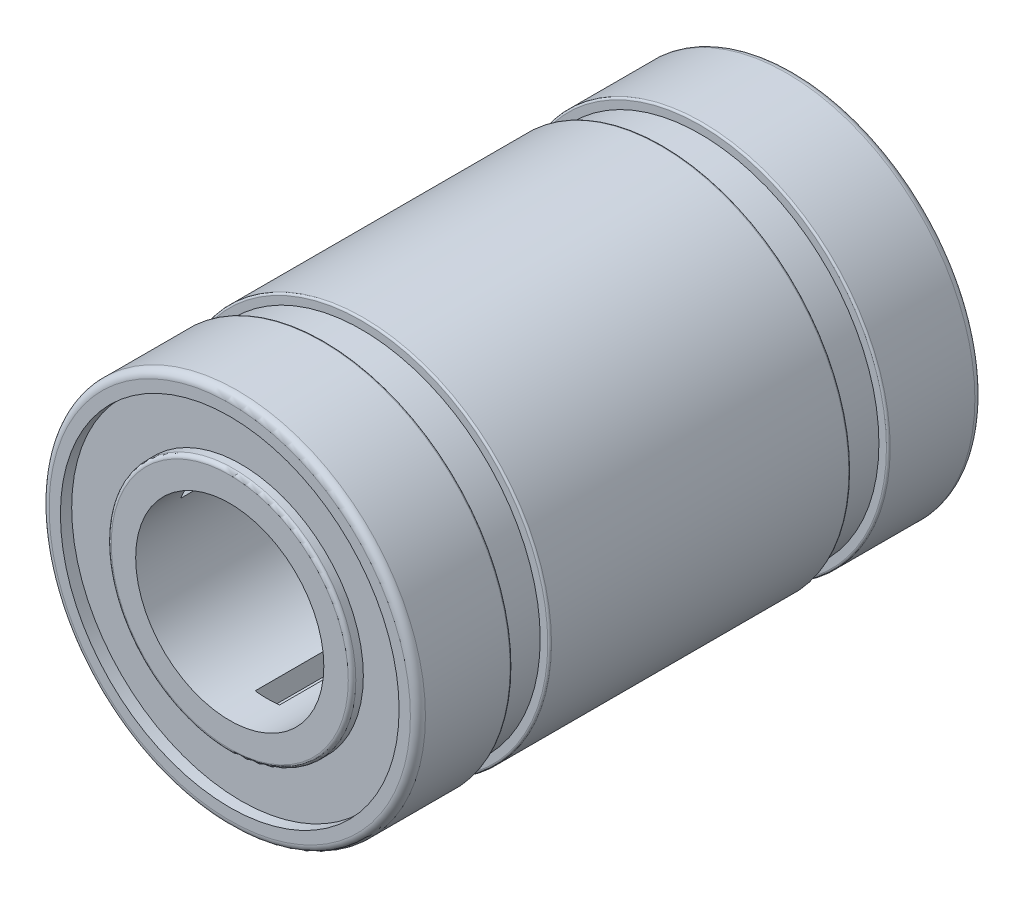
from build123d import *

# Parameters (mm, degrees)
BOSS_EXTRUDE1_DEPTH      = 4
BOSS_EXTRUDE1_DEPTH_BACK = 4
SKETCH1_R                = 5
BOSS_EXTRUDE2_DEPTH      = 1
BOSS_EXTRUDE2_DEPTH_BACK = 9
SKETCH2_R                = 4.75
SKETCH3_R                = 5
BOSS_EXTRUDE3_DEPTH      = 2.5
BOSS_EXTRUDE4_START      = 2.5
SKETCH4_R                = 5
BOSS_EXTRUDE4_DEPTH      = 2.5
SKETCH5_R                = 4.5
CUT_EXTRUDE1_DEPTH       = 0.3
CUT_EXTRUDE2_START       = -0.3
SKETCH6_R                = 4.5
CUT_EXTRUDE2_DEPTH       = 0.3
SKETCH7_R                = 3.25
BOSS_EXTRUDE5_DEPTH      = 0.3
BOSS_EXTRUDE6_START      = 0.3
SKETCH8_R                = 3.25
BOSS_EXTRUDE6_DEPTH      = 0.3
SKETCH9_R                = 2.5
CUT_EXTRUDE3_DEPTH       = 20.3
SKETCH10_W               = 0.64983534
SKETCH10_H               = 1.129620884
CUT_EXTRUDE4_DEPTH       = 14
BOSS_EXTRUDE7_START      = -1
SKETCH11_R               = 3.25
SKETCH11_R_2             = 2.5
BOSS_EXTRUDE7_DEPTH      = 1
FILLET1_R                = 0.2
FILLET2_R                = 0.05
FILLET3_R                = 0.1


with BuildPart() as part:
    # Sketch1 → Boss-Extrude1 (new, two sides: drawn at the far end of the back side and taken through both)
    with BuildSketch(Plane.XY.offset(-BOSS_EXTRUDE1_DEPTH_BACK)):
        Circle(SKETCH1_R)
    extrude(amount=BOSS_EXTRUDE1_DEPTH + BOSS_EXTRUDE1_DEPTH_BACK)

    # Sketch2 → Boss-Extrude2 (add, two sides: drawn at the far end of the back side and taken through both)
    with BuildSketch(Plane.XY.offset(4).offset(-BOSS_EXTRUDE2_DEPTH_BACK)):
        Circle(SKETCH2_R)
    extrude(amount=BOSS_EXTRUDE2_DEPTH + BOSS_EXTRUDE2_DEPTH_BACK)

    # Sketch3 → Boss-Extrude3 (add)
    with BuildSketch(Plane.XY.offset(5)):
        Circle(SKETCH3_R)
    extrude(amount=BOSS_EXTRUDE3_DEPTH)

    # Sketch4 → Boss-Extrude4 (add)
    with BuildSketch(Plane(origin=(0, 0, -5), x_dir=(-1, 0, 0), z_dir=(0, 0, -1)).offset(BOSS_EXTRUDE4_START)):
        with Locations(Location((0, 0, 0), (0, 0, 180))):
            Circle(SKETCH4_R)
    extrude(amount=-BOSS_EXTRUDE4_DEPTH)

    # Sketch5 → Cut-Extrude1 (cut)
    with BuildSketch(Plane.XY.offset(7.5)):
        Circle(SKETCH5_R)
    extrude(amount=-CUT_EXTRUDE1_DEPTH, mode=Mode.SUBTRACT)

    # Sketch6 → Cut-Extrude2 (cut)
    with BuildSketch(Plane(origin=(0, 0, -7.5), x_dir=(-1, 0, 0), z_dir=(0, 0, -1)).offset(CUT_EXTRUDE2_START)):
        with Locations(Location((0, 0, 0), (0, 0, 180))):
            Circle(SKETCH6_R)
    extrude(amount=CUT_EXTRUDE2_DEPTH, mode=Mode.SUBTRACT)

    # Sketch7 → Boss-Extrude5 (add)
    with BuildSketch(Plane(origin=(0, 0, -7.2), x_dir=(-1, 0, 0), z_dir=(0, 0, -1))):
        Circle(SKETCH7_R)
    extrude(amount=BOSS_EXTRUDE5_DEPTH)

    # Sketch8 → Boss-Extrude6 (add)
    with BuildSketch(Plane.XY.offset(7.2).offset(BOSS_EXTRUDE6_START)):
        with Locations(Location((0, 0, 0), (0, 0, 180))):
            Circle(SKETCH8_R)
    extrude(amount=-BOSS_EXTRUDE6_DEPTH)

    # Sketch9 → Cut-Extrude3 (cut)
    with BuildSketch(Plane(origin=(0, 0, -7.5), x_dir=(-1, 0, 0), z_dir=(0, 0, -1))):
        Circle(SKETCH9_R)
    extrude(amount=-CUT_EXTRUDE3_DEPTH, mode=Mode.SUBTRACT)

    # Sketch10 → Cut-Extrude4 (cut)
    with BuildSketch(Plane(origin=(0, 0, -7.5), x_dir=(-1, 0, 0), z_dir=(0, 0, -1))):
        with Locations((0, -2.5)):
            Rectangle(SKETCH10_W, SKETCH10_H)
        Polygon((-1.513464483, 1.248981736), (-2.491744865, 1.813792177), (-2.816662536, 1.251018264), (-1.838382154, 0.686207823), align=None)
        Polygon((1.838382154, 0.686207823), (2.816662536, 1.251018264), (2.491744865, 1.813792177), (1.513464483, 1.248981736), align=None)
    extrude(amount=-CUT_EXTRUDE4_DEPTH, mode=Mode.SUBTRACT)

    # Sketch11 → Boss-Extrude7 (add)
    with BuildSketch(Plane(origin=(0, 0, -7.5), x_dir=(-1, 0, 0), z_dir=(0, 0, -1)).offset(BOSS_EXTRUDE7_START)):
        Circle(SKETCH11_R)
        Circle(SKETCH11_R_2, mode=Mode.SUBTRACT)
    extrude(amount=BOSS_EXTRUDE7_DEPTH)

    # Fillet1
    fillet1_edges = [part.edges().sort_by_distance(p)[0] for p in [
        (-5, 0, 7.5),
        (-5, 0, -7.5),
    ]]
    fillet(fillet1_edges, radius=FILLET1_R)

    # Fillet2
    fillet2_edges = [part.edges().sort_by_distance(p)[0] for p in [
        (-5, 0, 5),
        (-5, 0, -5),
        (-5, 0, -4),
        (-5, 0, 4),
    ]]
    fillet(fillet2_edges, radius=FILLET2_R)

    # Fillet3
    fillet3_edges = [part.edges().sort_by_distance(p)[0] for p in [
        (3.25, 0, -7.5),
        (3.25, 0, 7.5),
    ]]
    fillet(fillet3_edges, radius=FILLET3_R)


solid = part.part
